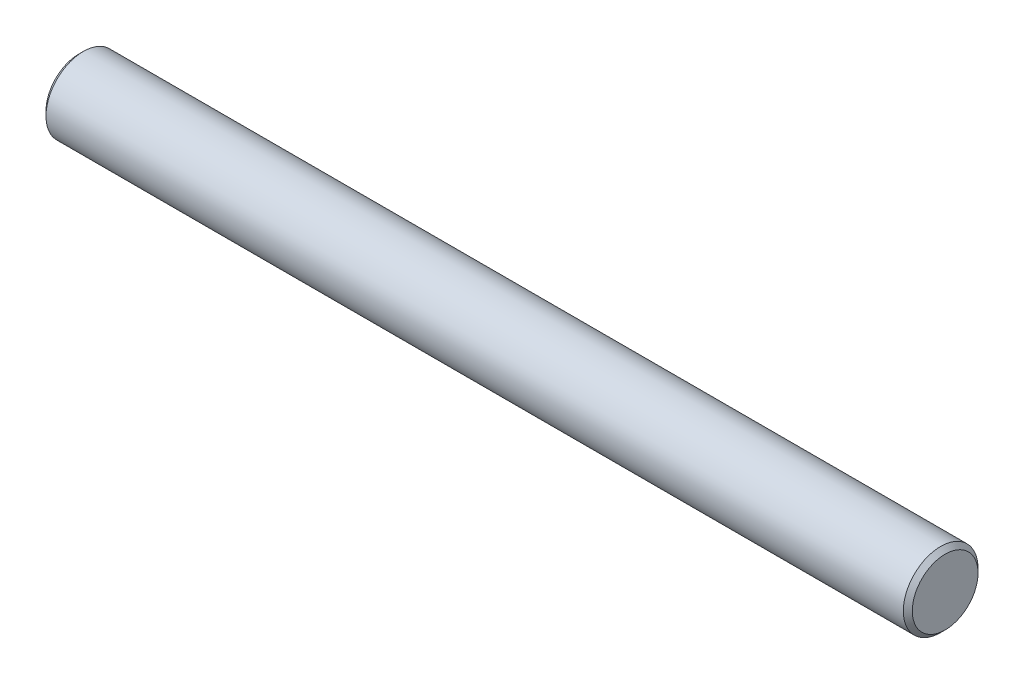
ISO-10303-21;
HEADER;
FILE_DESCRIPTION(('STEP AP214'),'2;1');
FILE_NAME('part.step','',(''),(''),'','','');
FILE_SCHEMA(('AUTOMOTIVE_DESIGN { 1 0 10303 214 1 1 1 1 }'));
ENDSEC;
DATA;
#1=APPLICATION_CONTEXT('core data for automotive mechanical design processes');
#2=APPLICATION_PROTOCOL_DEFINITION('international standard','automotive_design',2000,#1);
#3=PRODUCT_CONTEXT('',#1,'mechanical');
#4=PRODUCT('Part','Part','',(#3));
#5=PRODUCT_RELATED_PRODUCT_CATEGORY('part','',(#4));
#6=PRODUCT_DEFINITION_FORMATION('','',#4);
#7=PRODUCT_DEFINITION_CONTEXT('part definition',#1,'design');
#8=PRODUCT_DEFINITION('design','',#6,#7);
#9=PRODUCT_DEFINITION_SHAPE('','',#8);
#10=(LENGTH_UNIT() NAMED_UNIT(*) SI_UNIT(.MILLI.,.METRE.));
#11=(NAMED_UNIT(*) PLANE_ANGLE_UNIT() SI_UNIT($,.RADIAN.));
#12=(NAMED_UNIT(*) SI_UNIT($,.STERADIAN.) SOLID_ANGLE_UNIT());
#13=UNCERTAINTY_MEASURE_WITH_UNIT(LENGTH_MEASURE(1.E-05),#10,'distance_accuracy_value','');
#14=(GEOMETRIC_REPRESENTATION_CONTEXT(3) GLOBAL_UNCERTAINTY_ASSIGNED_CONTEXT((#13)) GLOBAL_UNIT_ASSIGNED_CONTEXT((#10,
#11,#12)) REPRESENTATION_CONTEXT('',''));
#15=CARTESIAN_POINT('',(0.,0.,0.));
#16=DIRECTION('',(0.,0.,1.));
#17=DIRECTION('',(1.,0.,0.));
#18=AXIS2_PLACEMENT_3D('',#15,#16,#17);
#19=CARTESIAN_POINT('',(29.,0.,0.));
#20=DIRECTION('',(-1.,0.,0.));
#21=DIRECTION('',(0.,0.,1.));
#22=AXIS2_PLACEMENT_3D('',#19,#20,#21);
#23=CYLINDRICAL_SURFACE('',#22,2.5);
#24=CARTESIAN_POINT('',(-28.7,0.,0.));
#25=DIRECTION('',(1.,0.,0.));
#26=DIRECTION('',(0.,0.,-1.));
#27=AXIS2_PLACEMENT_3D('',#24,#25,#26);
#28=CIRCLE('',#27,2.5);
#29=CARTESIAN_POINT('',(-28.7,0.,2.5));
#30=VERTEX_POINT('',#29);
#31=EDGE_CURVE('E47',#30,#30,#28,.T.);
#32=CARTESIAN_POINT('',(28.7,0.,0.));
#33=DIRECTION('',(1.,0.,0.));
#34=DIRECTION('',(0.,0.,-1.));
#35=AXIS2_PLACEMENT_3D('',#32,#33,#34);
#36=CIRCLE('',#35,2.5);
#37=CARTESIAN_POINT('',(28.7,0.,2.5));
#38=VERTEX_POINT('',#37);
#39=EDGE_CURVE('E51',#38,#38,#36,.F.);
#40=CARTESIAN_POINT('',(-28.7,0.,2.5));
#41=CARTESIAN_POINT('',(-28.1020833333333,0.,2.5));
#42=CARTESIAN_POINT('',(-27.5041666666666,0.,2.5));
#43=CARTESIAN_POINT('',(-26.3083333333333,0.,2.5));
#44=CARTESIAN_POINT('',(-25.7104166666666,0.,2.5));
#45=CARTESIAN_POINT('',(-24.5145833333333,0.,2.5));
#46=CARTESIAN_POINT('',(-23.9166666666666,0.,2.5));
#47=CARTESIAN_POINT('',(-22.7208333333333,0.,2.5));
#48=CARTESIAN_POINT('',(-22.1229166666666,0.,2.5));
#49=CARTESIAN_POINT('',(-20.9270833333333,0.,2.5));
#50=CARTESIAN_POINT('',(-20.3291666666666,0.,2.5));
#51=CARTESIAN_POINT('',(-19.1333333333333,0.,2.5));
#52=CARTESIAN_POINT('',(-18.5354166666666,0.,2.5));
#53=CARTESIAN_POINT('',(-17.3395833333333,0.,2.5));
#54=CARTESIAN_POINT('',(-16.7416666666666,0.,2.5));
#55=CARTESIAN_POINT('',(-15.5458333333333,0.,2.5));
#56=CARTESIAN_POINT('',(-14.9479166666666,0.,2.5));
#57=CARTESIAN_POINT('',(-13.7520833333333,0.,2.5));
#58=CARTESIAN_POINT('',(-13.1541666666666,0.,2.5));
#59=CARTESIAN_POINT('',(-11.9583333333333,0.,2.5));
#60=CARTESIAN_POINT('',(-11.3604166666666,0.,2.5));
#61=CARTESIAN_POINT('',(-10.1645833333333,0.,2.5));
#62=CARTESIAN_POINT('',(-9.56666666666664,0.,2.5));
#63=CARTESIAN_POINT('',(-8.37083333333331,0.,2.5));
#64=CARTESIAN_POINT('',(-7.77291666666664,0.,2.5));
#65=CARTESIAN_POINT('',(-6.57708333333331,0.,2.5));
#66=CARTESIAN_POINT('',(-5.97916666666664,0.,2.5));
#67=CARTESIAN_POINT('',(-4.78333333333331,0.,2.5));
#68=CARTESIAN_POINT('',(-4.18541666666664,0.,2.5));
#69=CARTESIAN_POINT('',(-2.98958333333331,0.,2.5));
#70=CARTESIAN_POINT('',(-2.39166666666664,0.,2.5));
#71=CARTESIAN_POINT('',(-1.19583333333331,0.,2.5));
#72=CARTESIAN_POINT('',(-0.597916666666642,0.,2.5));
#73=CARTESIAN_POINT('',(0.597916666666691,0.,2.5));
#74=CARTESIAN_POINT('',(1.19583333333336,0.,2.5));
#75=CARTESIAN_POINT('',(2.39166666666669,0.,2.5));
#76=CARTESIAN_POINT('',(2.98958333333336,0.,2.5));
#77=CARTESIAN_POINT('',(4.18541666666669,0.,2.5));
#78=CARTESIAN_POINT('',(4.78333333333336,0.,2.5));
#79=CARTESIAN_POINT('',(5.97916666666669,0.,2.5));
#80=CARTESIAN_POINT('',(6.57708333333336,0.,2.5));
#81=CARTESIAN_POINT('',(7.77291666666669,0.,2.5));
#82=CARTESIAN_POINT('',(8.37083333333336,0.,2.5));
#83=CARTESIAN_POINT('',(9.56666666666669,0.,2.5));
#84=CARTESIAN_POINT('',(10.1645833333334,0.,2.5));
#85=CARTESIAN_POINT('',(11.3604166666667,0.,2.5));
#86=CARTESIAN_POINT('',(11.9583333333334,0.,2.5));
#87=CARTESIAN_POINT('',(13.1541666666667,0.,2.5));
#88=CARTESIAN_POINT('',(13.7520833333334,0.,2.5));
#89=CARTESIAN_POINT('',(14.9479166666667,0.,2.5));
#90=CARTESIAN_POINT('',(15.5458333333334,0.,2.5));
#91=CARTESIAN_POINT('',(16.7416666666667,0.,2.5));
#92=CARTESIAN_POINT('',(17.3395833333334,0.,2.5));
#93=CARTESIAN_POINT('',(18.5354166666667,0.,2.5));
#94=CARTESIAN_POINT('',(19.1333333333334,0.,2.5));
#95=CARTESIAN_POINT('',(20.3291666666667,0.,2.5));
#96=CARTESIAN_POINT('',(20.9270833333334,0.,2.5));
#97=CARTESIAN_POINT('',(22.1229166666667,0.,2.5));
#98=CARTESIAN_POINT('',(22.7208333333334,0.,2.5));
#99=CARTESIAN_POINT('',(23.9166666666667,0.,2.5));
#100=CARTESIAN_POINT('',(24.5145833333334,0.,2.5));
#101=CARTESIAN_POINT('',(25.7104166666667,0.,2.5));
#102=CARTESIAN_POINT('',(26.3083333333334,0.,2.5));
#103=CARTESIAN_POINT('',(27.5041666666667,0.,2.5));
#104=CARTESIAN_POINT('',(28.1020833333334,0.,2.5));
#105=CARTESIAN_POINT('',(28.7,0.,2.5));
#106=B_SPLINE_CURVE_WITH_KNOTS('',3,(#40,#41,#42,#43,#44,#45,#46,#47,#48,#49,#50,#51,#52,#53,
#54,#55,#56,#57,#58,#59,#60,#61,#62,#63,#64,#65,#66,#67,#68,#69,#70,#71,#72,#73,#74,#75,#76,#77,
#78,#79,#80,#81,#82,#83,#84,#85,#86,#87,#88,#89,#90,#91,#92,#93,#94,#95,#96,#97,#98,#99,#100,
#101,#102,#103,#104,#105),.UNSPECIFIED.,.F.,.F.,(4,2,2,2,2,2,2,2,2,2,2,2,2,2,2,2,2,2,2,2,2,2,2,
2,2,2,2,2,2,2,2,2,4),(0.,1.79375,3.5875,5.38125,7.175,8.96875000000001,10.7625,12.55625,14.35,
16.14375,17.9375,19.73125,21.525,23.31875,25.1125,26.90625,28.7,30.49375,32.2875,34.08125,
35.875,37.66875,39.4625,41.25625,43.05,44.84375,46.6375,48.43125,50.225,52.01875,53.8125,
55.60625,57.4),.UNSPECIFIED.);
#107=EDGE_CURVE('BSEAM36',#30,#38,#106,.T.);
#108=ORIENTED_EDGE('',*,*,#31,.T.);
#109=ORIENTED_EDGE('',*,*,#39,.T.);
#110=ORIENTED_EDGE('',*,*,#107,.T.);
#111=ORIENTED_EDGE('',*,*,#107,.F.);
#112=EDGE_LOOP('',(#108,#110,#109,#111));
#113=FACE_BOUND('',#112,.T.);
#114=ADVANCED_FACE('F36',(#113),#23,.T.);
#115=CARTESIAN_POINT('',(29.,0.,0.));
#116=DIRECTION('',(1.,0.,0.));
#117=DIRECTION('',(0.,0.,-1.));
#118=AXIS2_PLACEMENT_3D('',#115,#116,#117);
#119=PLANE('',#118);
#120=CARTESIAN_POINT('',(29.,0.,0.));
#121=DIRECTION('',(1.,0.,0.));
#122=DIRECTION('',(0.,0.,-1.));
#123=AXIS2_PLACEMENT_3D('',#120,#121,#122);
#124=CIRCLE('',#123,2.20000000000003);
#125=CARTESIAN_POINT('',(29.,0.,-2.20000000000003));
#126=VERTEX_POINT('',#125);
#127=EDGE_CURVE('E10',#126,#126,#124,.T.);
#128=ORIENTED_EDGE('',*,*,#127,.T.);
#129=EDGE_LOOP('',(#128));
#130=FACE_BOUND('',#129,.T.);
#131=ADVANCED_FACE('F67',(#130),#119,.T.);
#132=CARTESIAN_POINT('',(-29.,0.,0.));
#133=DIRECTION('',(1.,0.,0.));
#134=DIRECTION('',(0.,0.,-1.));
#135=AXIS2_PLACEMENT_3D('',#132,#133,#134);
#136=PLANE('',#135);
#137=CARTESIAN_POINT('',(-29.,0.,0.));
#138=DIRECTION('',(1.,0.,0.));
#139=DIRECTION('',(0.,0.,-1.));
#140=AXIS2_PLACEMENT_3D('',#137,#138,#139);
#141=CIRCLE('',#140,2.19999999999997);
#142=CARTESIAN_POINT('',(-29.,0.,-2.19999999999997));
#143=VERTEX_POINT('',#142);
#144=EDGE_CURVE('E43',#143,#143,#141,.F.);
#145=ORIENTED_EDGE('',*,*,#144,.T.);
#146=EDGE_LOOP('',(#145));
#147=FACE_BOUND('',#146,.T.);
#148=ADVANCED_FACE('F64',(#147),#136,.F.);
#149=CARTESIAN_POINT('',(-28.7,0.,0.));
#150=DIRECTION('',(1.,0.,0.));
#151=DIRECTION('',(0.,0.,-1.));
#152=AXIS2_PLACEMENT_3D('',#149,#150,#151);
#153=CONICAL_SURFACE('',#152,2.5,0.785398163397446);
#154=ORIENTED_EDGE('',*,*,#144,.F.);
#155=EDGE_LOOP('',(#154));
#156=FACE_BOUND('',#155,.T.);
#157=ORIENTED_EDGE('',*,*,#31,.F.);
#158=EDGE_LOOP('',(#157));
#159=FACE_BOUND('',#158,.T.);
#160=ADVANCED_FACE('F60',(#156,#159),#153,.T.);
#161=CARTESIAN_POINT('',(29.,0.,0.));
#162=DIRECTION('',(-1.,0.,0.));
#163=DIRECTION('',(0.,0.,1.));
#164=AXIS2_PLACEMENT_3D('',#161,#162,#163);
#165=CONICAL_SURFACE('',#164,2.20000000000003,0.785398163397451);
#166=ORIENTED_EDGE('',*,*,#39,.F.);
#167=EDGE_LOOP('',(#166));
#168=FACE_BOUND('',#167,.T.);
#169=ORIENTED_EDGE('',*,*,#127,.F.);
#170=EDGE_LOOP('',(#169));
#171=FACE_BOUND('',#170,.T.);
#172=ADVANCED_FACE('F38',(#168,#171),#165,.T.);
#173=CLOSED_SHELL('',(#114,#131,#148,#160,#172));
#174=MANIFOLD_SOLID_BREP('B2',#173);
#175=ADVANCED_BREP_SHAPE_REPRESENTATION('',(#18,#174),#14);
#176=SHAPE_DEFINITION_REPRESENTATION(#9,#175);
ENDSEC;
END-ISO-10303-21;
